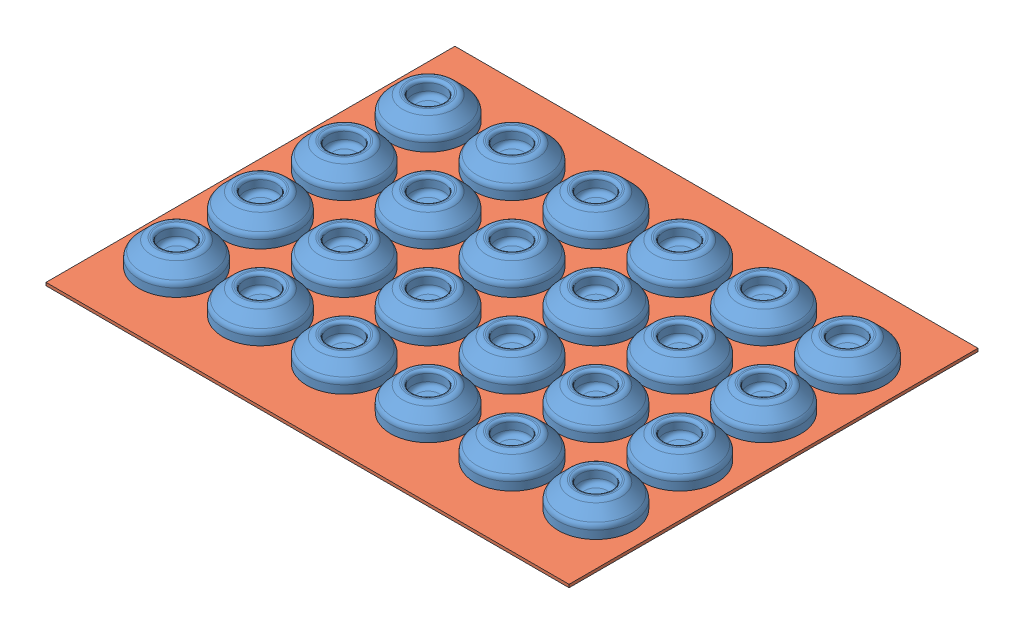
SolidWorks assembly vac form assy.SLDASM, configuration Default (file format 5000). Lengths in mm.
Overall size (629.25 19 441.05).
25 component instances, 2 part files, 4 mates.
Components (placement in the parent):
- air cell-1: air cell.SLDPRT [Default] at origin size (50 17 50)
- air cell-2: air cell.SLDPRT [Default] at (0 0 56) size (50 17 50)
- air cell-3: air cell.SLDPRT [Default] at (0 0 112) size (50 17 50)
- air cell-4: air cell.SLDPRT [Default] at (0 0 168) size (50 17 50)
- air cell-5: air cell.SLDPRT [Default] at (56 0 0) size (50 17 50)
- air cell-6: air cell.SLDPRT [Default] at (56 0 56) size (50 17 50)
- air cell-7: air cell.SLDPRT [Default] at (56 0 112) size (50 17 50)
- air cell-8: air cell.SLDPRT [Default] at (56 0 168) size (50 17 50)
- air cell-9: air cell.SLDPRT [Default] at (112 0 0) size (50 17 50)
- air cell-10: air cell.SLDPRT [Default] at (112 0 56) size (50 17 50)
- air cell-11: air cell.SLDPRT [Default] at (112 0 112) size (50 17 50)
- air cell-12: air cell.SLDPRT [Default] at (112 0 168) size (50 17 50)
- air cell-13: air cell.SLDPRT [Default] at (168 0 0) size (50 17 50)
- air cell-14: air cell.SLDPRT [Default] at (168 0 56) size (50 17 50)
- air cell-15: air cell.SLDPRT [Default] at (168 0 112) size (50 17 50)
- air cell-16: air cell.SLDPRT [Default] at (168 0 168) size (50 17 50)
- air cell-17: air cell.SLDPRT [Default] at (224 0 0) size (50 17 50)
- air cell-18: air cell.SLDPRT [Default] at (224 0 56) size (50 17 50)
- air cell-19: air cell.SLDPRT [Default] at (224 0 112) size (50 17 50)
- air cell-20: air cell.SLDPRT [Default] at (224 0 168) size (50 17 50)
- air cell-21: air cell.SLDPRT [Default] at (280 0 0) size (50 17 50)
- air cell-22: air cell.SLDPRT [Default] at (280 0 56) size (50 17 50)
- air cell-23: air cell.SLDPRT [Default] at (280 0 112) size (50 17 50)
- air cell-24: air cell.SLDPRT [Default] at (280 0 168) size (50 17 50)
- backer plate-1: backer plate.SLDPRT [Default] at (280 0 0) x (-1 0 0) z (0 -1 0) size (349.25 273.05 2)
Mates (geometry in assembly coordinates):
- InPlace1: in place: plane of air cell-21 through (280 0 0) normal (0 -1 0); plane of ? through (0 0 0) normal (0 -1 0); moOrthogonalPlaneRef_w of air cell-21 through (280 0 0) normal (0 -1 0); unknown of ?; plane of air cell-21 through (280 0 0) normal (0 -1 0); line of ? through (55 -55 0) axis (0 0 -1); plane of air cell-21 through (280 0 0) normal (0 -1 0); unknown of backer plate-1
- Coincident1: coincident aligned: plane of air cell-21; plane of backer plate-1
- Coincident2: coincident aligned: moOrthogonalPlaneRef_w of air cell-21 through (280 0 0) normal (0 0 -1); plane of backer plate-1
- Coincident3: coincident anti-aligned: moOrthogonalPlaneRef_w of air cell-21 through (280 0 0) normal (1 0 0); plane of backer plate-1
